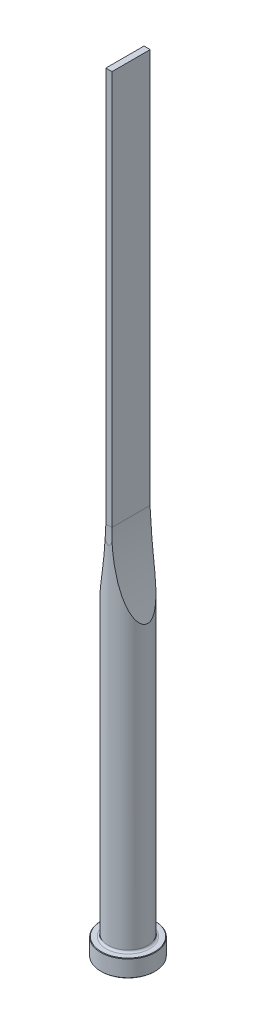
from build123d import *

# Parameters (mm, degrees)
CUT_EXTRUDE1_DEPTH = 10
CUT_EXTRUDE2_DEPTH = 10


with BuildPart() as part:
    # Sketch1 → Revolve1 (revolve)
    with BuildSketch(Plane.XY, mode=Mode.PRIVATE) as revolve1_sk:
        with BuildLine():
            Line((0, 0), (10.8, 0))
            Line((10.8, 0), (11, 0.2))
            Line((11, 0.2), (11, 6.8))
            Line((11, 6.8), (10.8, 7))
            Line((10.8, 7), (8.8, 7))
            ThreePointArc((8.8, 7), (8.234314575, 7.234314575), (8, 7.8))
            Line((8, 7.8), (8, 315))
            Line((8, 315), (0, 315))
            Line((0, 315), (0, 0))
        make_face()
    revolve(revolve1_sk.sketch.rotate(Axis((0, 315, 0), (0, -1, 0)), 180), axis=Axis((0, 315, 0), (0, -1, 0)))

    # Sketch2 → Cut-Extrude1 (cut, symmetric)
    with BuildSketch(Plane.XY):
        with BuildLine():
            Line((1.25, 315), (1.25, 155))
            ThreePointArc((1.25, 155), (2.953624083, 137.571574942), (8, 120.802960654))
            Line((8, 120.802960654), (8, 315))
            Line((8, 315), (1.25, 315))
        make_face()
        with BuildLine():
            Line((-1.25, 315), (-1.25, 155))
            ThreePointArc((-1.25, 155), (-2.953624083, 137.571574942), (-8, 120.802960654))
            Line((-8, 120.802960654), (-8, 315))
            Line((-8, 315), (-1.25, 315))
        make_face()
    extrude(amount=CUT_EXTRUDE1_DEPTH, both=True, mode=Mode.SUBTRACT)

    # Sketch3 → Cut-Extrude2 (cut, symmetric)
    with BuildSketch(Plane(origin=(0, 0, 0), x_dir=(0, 0, -1), z_dir=(1, 0, 0))):
        with BuildLine():
            Line((7.75, 315), (7.75, 155))
            ThreePointArc((7.75, 155), (7.812521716, 151.645898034), (8, 148.296456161))
            Line((8, 148.296456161), (8, 315))
            Line((8, 315), (7.75, 315))
        make_face()
        with BuildLine():
            Line((-7.75, 315), (-7.75, 155))
            ThreePointArc((-7.75, 155), (-7.812521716, 151.645898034), (-8, 148.296456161))
            Line((-8, 148.296456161), (-8, 315))
            Line((-8, 315), (-7.75, 315))
        make_face()
    extrude(amount=CUT_EXTRUDE2_DEPTH, both=True, mode=Mode.SUBTRACT)


solid = part.part
